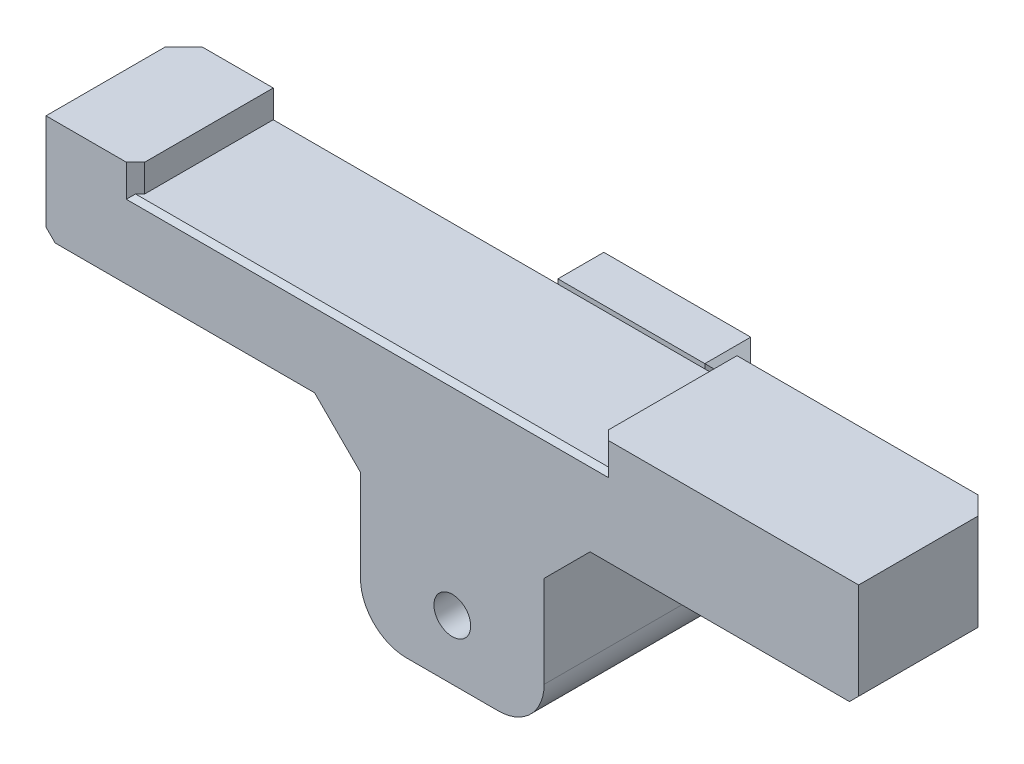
ISO-10303-21;
HEADER;
FILE_DESCRIPTION(('STEP AP214'),'2;1');
FILE_NAME('part.step','',(''),(''),'','','');
FILE_SCHEMA(('AUTOMOTIVE_DESIGN { 1 0 10303 214 1 1 1 1 }'));
ENDSEC;
DATA;
#1=APPLICATION_CONTEXT('core data for automotive mechanical design processes');
#2=APPLICATION_PROTOCOL_DEFINITION('international standard','automotive_design',2000,#1);
#3=PRODUCT_CONTEXT('',#1,'mechanical');
#4=PRODUCT('Part','Part','',(#3));
#5=PRODUCT_RELATED_PRODUCT_CATEGORY('part','',(#4));
#6=PRODUCT_DEFINITION_FORMATION('','',#4);
#7=PRODUCT_DEFINITION_CONTEXT('part definition',#1,'design');
#8=PRODUCT_DEFINITION('design','',#6,#7);
#9=PRODUCT_DEFINITION_SHAPE('','',#8);
#10=(LENGTH_UNIT() NAMED_UNIT(*) SI_UNIT(.MILLI.,.METRE.));
#11=(NAMED_UNIT(*) PLANE_ANGLE_UNIT() SI_UNIT($,.RADIAN.));
#12=(NAMED_UNIT(*) SI_UNIT($,.STERADIAN.) SOLID_ANGLE_UNIT());
#13=UNCERTAINTY_MEASURE_WITH_UNIT(LENGTH_MEASURE(1.E-05),#10,'distance_accuracy_value','');
#14=(GEOMETRIC_REPRESENTATION_CONTEXT(3) GLOBAL_UNCERTAINTY_ASSIGNED_CONTEXT((#13)) GLOBAL_UNIT_ASSIGNED_CONTEXT((#10,
#11,#12)) REPRESENTATION_CONTEXT('',''));
#15=CARTESIAN_POINT('',(0.,0.,0.));
#16=DIRECTION('',(0.,0.,1.));
#17=DIRECTION('',(1.,0.,0.));
#18=AXIS2_PLACEMENT_3D('',#15,#16,#17);
#19=CARTESIAN_POINT('',(-88.5,11.5,30.));
#20=DIRECTION('',(0.,-1.,0.));
#21=DIRECTION('',(0.,0.,-1.));
#22=AXIS2_PLACEMENT_3D('',#19,#20,#21);
#23=PLANE('',#22);
#24=DIRECTION('',(-1.,0.,0.));
#25=VECTOR('',#24,1.);
#26=CARTESIAN_POINT('',(-88.5,11.5,30.));
#27=LINE('',#26,#25);
#28=CARTESIAN_POINT('',(-71.,11.5,30.));
#29=VERTEX_POINT('',#28);
#30=CARTESIAN_POINT('',(-88.5,11.5,30.));
#31=VERTEX_POINT('',#30);
#32=EDGE_CURVE('E541',#29,#31,#27,.T.);
#33=ORIENTED_EDGE('',*,*,#32,.F.);
#34=DIRECTION('',(-0.707106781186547,0.,0.707106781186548));
#35=VECTOR('',#34,1.);
#36=CARTESIAN_POINT('',(-69.,11.5,28.));
#37=LINE('',#36,#35);
#38=CARTESIAN_POINT('',(-69.,11.5,28.));
#39=VERTEX_POINT('',#38);
#40=EDGE_CURVE('E454',#29,#39,#37,.F.);
#41=ORIENTED_EDGE('',*,*,#40,.T.);
#42=DIRECTION('',(0.,0.,1.));
#43=VECTOR('',#42,1.);
#44=CARTESIAN_POINT('',(-69.,11.5,-19.001));
#45=LINE('',#44,#43);
#46=CARTESIAN_POINT('',(-69.,11.5,0.));
#47=VERTEX_POINT('',#46);
#48=EDGE_CURVE('E289',#47,#39,#45,.T.);
#49=ORIENTED_EDGE('',*,*,#48,.F.);
#50=DIRECTION('',(-1.,0.,0.));
#51=VECTOR('',#50,1.);
#52=CARTESIAN_POINT('',(-88.5,11.5,0.));
#53=LINE('',#52,#51);
#54=CARTESIAN_POINT('',(-84.5,11.5,0.));
#55=VERTEX_POINT('',#54);
#56=EDGE_CURVE('E306',#47,#55,#53,.T.);
#57=ORIENTED_EDGE('',*,*,#56,.T.);
#58=DIRECTION('',(-0.70710678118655,0.,0.707106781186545));
#59=VECTOR('',#58,1.);
#60=CARTESIAN_POINT('',(-88.5,11.5,4.));
#61=LINE('',#60,#59);
#62=CARTESIAN_POINT('',(-88.5,11.5,4.));
#63=VERTEX_POINT('',#62);
#64=EDGE_CURVE('E350',#55,#63,#61,.T.);
#65=ORIENTED_EDGE('',*,*,#64,.T.);
#66=DIRECTION('',(0.,0.,-1.));
#67=VECTOR('',#66,1.);
#68=CARTESIAN_POINT('',(-88.5,11.5,30.));
#69=LINE('',#68,#67);
#70=EDGE_CURVE('E318',#31,#63,#69,.T.);
#71=ORIENTED_EDGE('',*,*,#70,.F.);
#72=EDGE_LOOP('',(#33,#41,#49,#57,#65,#71));
#73=FACE_BOUND('',#72,.T.);
#74=ADVANCED_FACE('F38',(#73),#23,.F.);
#75=CARTESIAN_POINT('',(-88.5,-11.5,30.));
#76=DIRECTION('',(0.,1.,0.));
#77=DIRECTION('',(0.,0.,1.));
#78=AXIS2_PLACEMENT_3D('',#75,#76,#77);
#79=PLANE('',#78);
#80=DIRECTION('',(1.,0.,0.));
#81=VECTOR('',#80,1.);
#82=CARTESIAN_POINT('',(-88.5,-11.5,30.));
#83=LINE('',#82,#81);
#84=CARTESIAN_POINT('',(-86.5,-11.5,30.));
#85=VERTEX_POINT('',#84);
#86=CARTESIAN_POINT('',(-29.9999999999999,-11.5,30.));
#87=VERTEX_POINT('',#86);
#88=EDGE_CURVE('E313',#85,#87,#83,.T.);
#89=ORIENTED_EDGE('',*,*,#88,.F.);
#90=DIRECTION('',(0.,0.,-1.));
#91=VECTOR('',#90,1.);
#92=CARTESIAN_POINT('',(-86.5,-11.5,30.));
#93=LINE('',#92,#91);
#94=CARTESIAN_POINT('',(-86.5,-11.5,2.00000000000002));
#95=VERTEX_POINT('',#94);
#96=EDGE_CURVE('E435',#85,#95,#93,.T.);
#97=ORIENTED_EDGE('',*,*,#96,.T.);
#98=DIRECTION('',(0.70710678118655,0.,-0.707106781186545));
#99=VECTOR('',#98,1.);
#100=CARTESIAN_POINT('',(-88.5,-11.5,4.));
#101=LINE('',#100,#99);
#102=CARTESIAN_POINT('',(-84.5,-11.5,0.));
#103=VERTEX_POINT('',#102);
#104=EDGE_CURVE('E364',#95,#103,#101,.T.);
#105=ORIENTED_EDGE('',*,*,#104,.T.);
#106=DIRECTION('',(1.,0.,0.));
#107=VECTOR('',#106,1.);
#108=CARTESIAN_POINT('',(-88.5,-11.5,0.));
#109=LINE('',#108,#107);
#110=CARTESIAN_POINT('',(-29.9999999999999,-11.5,0.));
#111=VERTEX_POINT('',#110);
#112=EDGE_CURVE('E309',#103,#111,#109,.T.);
#113=ORIENTED_EDGE('',*,*,#112,.T.);
#114=DIRECTION('',(0.,0.,1.));
#115=VECTOR('',#114,1.);
#116=CARTESIAN_POINT('',(-29.9999999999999,-11.5,30.));
#117=LINE('',#116,#115);
#118=EDGE_CURVE('E337',#111,#87,#117,.T.);
#119=ORIENTED_EDGE('',*,*,#118,.T.);
#120=EDGE_LOOP('',(#89,#97,#105,#113,#119));
#121=FACE_BOUND('',#120,.T.);
#122=ADVANCED_FACE('F559',(#121),#79,.F.);
#123=CARTESIAN_POINT('',(88.5,-11.5,30.));
#124=DIRECTION('',(-1.,0.,0.));
#125=DIRECTION('',(0.,0.,1.));
#126=AXIS2_PLACEMENT_3D('',#123,#124,#125);
#127=PLANE('',#126);
#128=DIRECTION('',(0.,1.,0.));
#129=VECTOR('',#128,1.);
#130=CARTESIAN_POINT('',(88.5,-11.5,30.));
#131=LINE('',#130,#129);
#132=CARTESIAN_POINT('',(88.5,-9.49999999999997,30.));
#133=VERTEX_POINT('',#132);
#134=CARTESIAN_POINT('',(88.5,11.5,30.));
#135=VERTEX_POINT('',#134);
#136=EDGE_CURVE('E317',#133,#135,#131,.T.);
#137=ORIENTED_EDGE('',*,*,#136,.F.);
#138=DIRECTION('',(0.,0.,-1.));
#139=VECTOR('',#138,1.);
#140=CARTESIAN_POINT('',(88.5,-9.49999999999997,30.));
#141=LINE('',#140,#139);
#142=CARTESIAN_POINT('',(88.5,-9.49999999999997,4.));
#143=VERTEX_POINT('',#142);
#144=EDGE_CURVE('E424',#133,#143,#141,.T.);
#145=ORIENTED_EDGE('',*,*,#144,.T.);
#146=DIRECTION('',(0.,1.,0.));
#147=VECTOR('',#146,1.);
#148=CARTESIAN_POINT('',(88.5,11.5,4.));
#149=LINE('',#148,#147);
#150=CARTESIAN_POINT('',(88.5,11.5,4.));
#151=VERTEX_POINT('',#150);
#152=EDGE_CURVE('E348',#143,#151,#149,.T.);
#153=ORIENTED_EDGE('',*,*,#152,.T.);
#154=DIRECTION('',(0.,0.,-1.));
#155=VECTOR('',#154,1.);
#156=CARTESIAN_POINT('',(88.5,11.5,30.));
#157=LINE('',#156,#155);
#158=EDGE_CURVE('E321',#135,#151,#157,.T.);
#159=ORIENTED_EDGE('',*,*,#158,.F.);
#160=EDGE_LOOP('',(#137,#145,#153,#159));
#161=FACE_BOUND('',#160,.T.);
#162=ADVANCED_FACE('F593',(#161),#127,.F.);
#163=DIRECTION('',(0.,0.,1.));
#164=VECTOR('',#163,1.);
#165=CARTESIAN_POINT('',(32.,11.5,-19.001));
#166=LINE('',#165,#164);
#167=CARTESIAN_POINT('',(32.,11.5,0.));
#168=VERTEX_POINT('',#167);
#169=CARTESIAN_POINT('',(32.,11.5,28.0000000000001));
#170=VERTEX_POINT('',#169);
#171=EDGE_CURVE('E279',#168,#170,#166,.T.);
#172=ORIENTED_EDGE('',*,*,#171,.T.);
#173=DIRECTION('',(-0.707106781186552,0.,-0.707106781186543));
#174=VECTOR('',#173,1.);
#175=CARTESIAN_POINT('',(32.,11.5,28.0000000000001));
#176=LINE('',#175,#174);
#177=CARTESIAN_POINT('',(34.,11.5,30.));
#178=VERTEX_POINT('',#177);
#179=EDGE_CURVE('E457',#170,#178,#176,.F.);
#180=ORIENTED_EDGE('',*,*,#179,.T.);
#181=EDGE_CURVE('E542',#135,#178,#27,.T.);
#182=ORIENTED_EDGE('',*,*,#181,.F.);
#183=ORIENTED_EDGE('',*,*,#158,.T.);
#184=DIRECTION('',(-0.70710678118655,0.,-0.707106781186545));
#185=VECTOR('',#184,1.);
#186=CARTESIAN_POINT('',(88.5,11.5,4.));
#187=LINE('',#186,#185);
#188=CARTESIAN_POINT('',(84.4999999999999,11.5,0.));
#189=VERTEX_POINT('',#188);
#190=EDGE_CURVE('E304',#151,#189,#187,.T.);
#191=ORIENTED_EDGE('',*,*,#190,.T.);
#192=EDGE_CURVE('E296',#189,#168,#53,.T.);
#193=ORIENTED_EDGE('',*,*,#192,.T.);
#194=EDGE_LOOP('',(#172,#180,#182,#183,#191,#193));
#195=FACE_BOUND('',#194,.T.);
#196=ADVANCED_FACE('F301',(#195),#23,.F.);
#197=CARTESIAN_POINT('',(-88.5,-11.5,30.));
#198=DIRECTION('',(1.,0.,0.));
#199=DIRECTION('',(0.,0.,-1.));
#200=AXIS2_PLACEMENT_3D('',#197,#198,#199);
#201=PLANE('',#200);
#202=DIRECTION('',(0.,-1.,0.));
#203=VECTOR('',#202,1.);
#204=CARTESIAN_POINT('',(-88.5,-11.5,4.));
#205=LINE('',#204,#203);
#206=CARTESIAN_POINT('',(-88.5,-9.5,4.));
#207=VERTEX_POINT('',#206);
#208=EDGE_CURVE('E361',#63,#207,#205,.T.);
#209=ORIENTED_EDGE('',*,*,#208,.T.);
#210=DIRECTION('',(0.,0.,1.));
#211=VECTOR('',#210,1.);
#212=CARTESIAN_POINT('',(-88.5,-9.5,30.));
#213=LINE('',#212,#211);
#214=CARTESIAN_POINT('',(-88.5,-9.5,30.));
#215=VERTEX_POINT('',#214);
#216=EDGE_CURVE('E440',#207,#215,#213,.T.);
#217=ORIENTED_EDGE('',*,*,#216,.T.);
#218=DIRECTION('',(0.,-1.,0.));
#219=VECTOR('',#218,1.);
#220=CARTESIAN_POINT('',(-88.5,-11.5,30.));
#221=LINE('',#220,#219);
#222=EDGE_CURVE('E544',#31,#215,#221,.T.);
#223=ORIENTED_EDGE('',*,*,#222,.F.);
#224=ORIENTED_EDGE('',*,*,#70,.T.);
#225=EDGE_LOOP('',(#209,#217,#223,#224));
#226=FACE_BOUND('',#225,.T.);
#227=ADVANCED_FACE('F600',(#226),#201,.F.);
#228=DIRECTION('',(0.70710678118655,0.,0.707106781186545));
#229=VECTOR('',#228,1.);
#230=CARTESIAN_POINT('',(88.5,-11.5,4.));
#231=LINE('',#230,#229);
#232=CARTESIAN_POINT('',(84.4999999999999,-11.5,0.));
#233=VERTEX_POINT('',#232);
#234=CARTESIAN_POINT('',(86.4999999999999,-11.5,1.99999999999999));
#235=VERTEX_POINT('',#234);
#236=EDGE_CURVE('E358',#233,#235,#231,.T.);
#237=ORIENTED_EDGE('',*,*,#236,.T.);
#238=DIRECTION('',(0.,0.,1.));
#239=VECTOR('',#238,1.);
#240=CARTESIAN_POINT('',(86.4999999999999,-11.5,30.));
#241=LINE('',#240,#239);
#242=CARTESIAN_POINT('',(86.4999999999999,-11.5,30.));
#243=VERTEX_POINT('',#242);
#244=EDGE_CURVE('E429',#235,#243,#241,.T.);
#245=ORIENTED_EDGE('',*,*,#244,.T.);
#246=CARTESIAN_POINT('',(30.0000000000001,-11.5,30.));
#247=VERTEX_POINT('',#246);
#248=EDGE_CURVE('E546',#247,#243,#83,.T.);
#249=ORIENTED_EDGE('',*,*,#248,.F.);
#250=DIRECTION('',(0.,0.,-1.));
#251=VECTOR('',#250,1.);
#252=CARTESIAN_POINT('',(30.0000000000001,-11.5,0.));
#253=LINE('',#252,#251);
#254=CARTESIAN_POINT('',(30.0000000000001,-11.5,0.));
#255=VERTEX_POINT('',#254);
#256=EDGE_CURVE('E323',#247,#255,#253,.T.);
#257=ORIENTED_EDGE('',*,*,#256,.T.);
#258=EDGE_CURVE('E305',#255,#233,#109,.T.);
#259=ORIENTED_EDGE('',*,*,#258,.T.);
#260=EDGE_LOOP('',(#237,#245,#249,#257,#259));
#261=FACE_BOUND('',#260,.T.);
#262=ADVANCED_FACE('F595',(#261),#79,.F.);
#263=CARTESIAN_POINT('',(0.,0.,30.));
#264=DIRECTION('',(0.,0.,-1.));
#265=DIRECTION('',(-1.,0.,0.));
#266=AXIS2_PLACEMENT_3D('',#263,#264,#265);
#267=PLANE('',#266);
#268=CARTESIAN_POINT('',(0.,-38.5,30.));
#269=DIRECTION('',(0.,0.,1.));
#270=DIRECTION('',(1.,0.,0.));
#271=AXIS2_PLACEMENT_3D('',#268,#269,#270);
#272=CIRCLE('',#271,4.);
#273=CARTESIAN_POINT('',(4.,-38.5,30.));
#274=VERTEX_POINT('',#273);
#275=EDGE_CURVE('E447',#274,#274,#272,.T.);
#276=ORIENTED_EDGE('',*,*,#275,.F.);
#277=EDGE_LOOP('',(#276));
#278=FACE_BOUND('',#277,.T.);
#279=DIRECTION('',(0.,-1.,0.));
#280=VECTOR('',#279,1.);
#281=CARTESIAN_POINT('',(-20.,0.,30.));
#282=LINE('',#281,#280);
#283=CARTESIAN_POINT('',(-20.,-21.5,30.));
#284=VERTEX_POINT('',#283);
#285=CARTESIAN_POINT('',(-20.,-41.5,30.));
#286=VERTEX_POINT('',#285);
#287=EDGE_CURVE('E531',#284,#286,#282,.T.);
#288=ORIENTED_EDGE('',*,*,#287,.T.);
#289=CARTESIAN_POINT('',(-10.,-41.5,30.));
#290=DIRECTION('',(0.,0.,-1.));
#291=DIRECTION('',(-1.,0.,0.));
#292=AXIS2_PLACEMENT_3D('',#289,#290,#291);
#293=CIRCLE('',#292,10.);
#294=CARTESIAN_POINT('',(-10.,-51.5,30.));
#295=VERTEX_POINT('',#294);
#296=EDGE_CURVE('E489',#286,#295,#293,.F.);
#297=ORIENTED_EDGE('',*,*,#296,.T.);
#298=DIRECTION('',(1.,0.,0.));
#299=VECTOR('',#298,1.);
#300=CARTESIAN_POINT('',(0.,-51.5,30.));
#301=LINE('',#300,#299);
#302=CARTESIAN_POINT('',(9.99999999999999,-51.5,30.));
#303=VERTEX_POINT('',#302);
#304=EDGE_CURVE('E311',#295,#303,#301,.T.);
#305=ORIENTED_EDGE('',*,*,#304,.T.);
#306=CARTESIAN_POINT('',(9.99999999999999,-41.5,30.));
#307=DIRECTION('',(0.,0.,-1.));
#308=DIRECTION('',(-1.,0.,0.));
#309=AXIS2_PLACEMENT_3D('',#306,#307,#308);
#310=CIRCLE('',#309,10.);
#311=CARTESIAN_POINT('',(20.,-41.5,30.));
#312=VERTEX_POINT('',#311);
#313=EDGE_CURVE('E59',#303,#312,#310,.F.);
#314=ORIENTED_EDGE('',*,*,#313,.T.);
#315=DIRECTION('',(0.,-1.,0.));
#316=VECTOR('',#315,1.);
#317=CARTESIAN_POINT('',(20.,0.,30.));
#318=LINE('',#317,#316);
#319=CARTESIAN_POINT('',(20.,-21.5,30.));
#320=VERTEX_POINT('',#319);
#321=EDGE_CURVE('E494',#320,#312,#318,.T.);
#322=ORIENTED_EDGE('',*,*,#321,.F.);
#323=DIRECTION('',(-0.707106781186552,-0.707106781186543,0.));
#324=VECTOR('',#323,1.);
#325=CARTESIAN_POINT('',(20.7499999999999,-20.7500000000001,30.));
#326=LINE('',#325,#324);
#327=EDGE_CURVE('E342',#320,#247,#326,.F.);
#328=ORIENTED_EDGE('',*,*,#327,.T.);
#329=ORIENTED_EDGE('',*,*,#248,.T.);
#330=DIRECTION('',(-0.707106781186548,-0.707106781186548,0.));
#331=VECTOR('',#330,1.);
#332=CARTESIAN_POINT('',(88.5,-9.49999999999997,30.));
#333=LINE('',#332,#331);
#334=EDGE_CURVE('E433',#243,#133,#333,.F.);
#335=ORIENTED_EDGE('',*,*,#334,.T.);
#336=ORIENTED_EDGE('',*,*,#136,.T.);
#337=ORIENTED_EDGE('',*,*,#181,.T.);
#338=DIRECTION('',(0.,-1.,0.));
#339=VECTOR('',#338,1.);
#340=CARTESIAN_POINT('',(34.,0.,30.));
#341=LINE('',#340,#339);
#342=CARTESIAN_POINT('',(34.,4.5,30.));
#343=VERTEX_POINT('',#342);
#344=EDGE_CURVE('E450',#178,#343,#341,.T.);
#345=ORIENTED_EDGE('',*,*,#344,.T.);
#346=DIRECTION('',(-1.,0.,0.));
#347=VECTOR('',#346,1.);
#348=CARTESIAN_POINT('',(0.,4.5,30.));
#349=LINE('',#348,#347);
#350=CARTESIAN_POINT('',(-71.,4.5,30.));
#351=VERTEX_POINT('',#350);
#352=EDGE_CURVE('E467',#343,#351,#349,.T.);
#353=ORIENTED_EDGE('',*,*,#352,.T.);
#354=DIRECTION('',(0.,1.,0.));
#355=VECTOR('',#354,1.);
#356=CARTESIAN_POINT('',(-71.,-1.64220489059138E-13,30.));
#357=LINE('',#356,#355);
#358=EDGE_CURVE('E452',#351,#29,#357,.T.);
#359=ORIENTED_EDGE('',*,*,#358,.T.);
#360=ORIENTED_EDGE('',*,*,#32,.T.);
#361=ORIENTED_EDGE('',*,*,#222,.T.);
#362=DIRECTION('',(-0.707106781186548,0.707106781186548,0.));
#363=VECTOR('',#362,1.);
#364=CARTESIAN_POINT('',(-86.5,-11.5,30.));
#365=LINE('',#364,#363);
#366=EDGE_CURVE('E431',#215,#85,#365,.F.);
#367=ORIENTED_EDGE('',*,*,#366,.T.);
#368=ORIENTED_EDGE('',*,*,#88,.T.);
#369=DIRECTION('',(0.707106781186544,-0.707106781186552,0.));
#370=VECTOR('',#369,1.);
#371=CARTESIAN_POINT('',(-20.7500000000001,-20.7499999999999,30.));
#372=LINE('',#371,#370);
#373=EDGE_CURVE('E346',#87,#284,#372,.T.);
#374=ORIENTED_EDGE('',*,*,#373,.T.);
#375=EDGE_LOOP('',(#288,#297,#305,#314,#322,#328,#329,#335,#336,#337,#345,#353,#359,#360,#361,
#367,#368,#374));
#376=FACE_BOUND('',#375,.T.);
#377=ADVANCED_FACE('F553',(#278,#376),#267,.F.);
#378=CARTESIAN_POINT('',(0.,0.,0.));
#379=DIRECTION('',(0.,0.,-1.));
#380=DIRECTION('',(-1.,0.,0.));
#381=AXIS2_PLACEMENT_3D('',#378,#379,#380);
#382=PLANE('',#381);
#383=DIRECTION('',(0.,-1.,0.));
#384=VECTOR('',#383,1.);
#385=CARTESIAN_POINT('',(-69.,11.5,0.));
#386=LINE('',#385,#384);
#387=CARTESIAN_POINT('',(-69.,5.5,0.));
#388=VERTEX_POINT('',#387);
#389=EDGE_CURVE('E299',#47,#388,#386,.T.);
#390=ORIENTED_EDGE('',*,*,#389,.T.);
#391=DIRECTION('',(1.,0.,0.));
#392=VECTOR('',#391,1.);
#393=CARTESIAN_POINT('',(-69.,5.5,0.));
#394=LINE('',#393,#392);
#395=CARTESIAN_POINT('',(32.,5.5,0.));
#396=VERTEX_POINT('',#395);
#397=EDGE_CURVE('E298',#388,#396,#394,.T.);
#398=ORIENTED_EDGE('',*,*,#397,.T.);
#399=DIRECTION('',(0.,1.,0.));
#400=VECTOR('',#399,1.);
#401=CARTESIAN_POINT('',(32.,11.5,0.));
#402=LINE('',#401,#400);
#403=EDGE_CURVE('E283',#396,#168,#402,.T.);
#404=ORIENTED_EDGE('',*,*,#403,.T.);
#405=ORIENTED_EDGE('',*,*,#192,.F.);
#406=DIRECTION('',(0.,-1.,0.));
#407=VECTOR('',#406,1.);
#408=CARTESIAN_POINT('',(84.4999999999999,-11.5,0.));
#409=LINE('',#408,#407);
#410=EDGE_CURVE('E356',#189,#233,#409,.T.);
#411=ORIENTED_EDGE('',*,*,#410,.T.);
#412=ORIENTED_EDGE('',*,*,#258,.F.);
#413=DIRECTION('',(0.707106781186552,0.707106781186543,0.));
#414=VECTOR('',#413,1.);
#415=CARTESIAN_POINT('',(30.0000000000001,-11.5,0.));
#416=LINE('',#415,#414);
#417=CARTESIAN_POINT('',(20.,-21.5,0.));
#418=VERTEX_POINT('',#417);
#419=EDGE_CURVE('E340',#255,#418,#416,.F.);
#420=ORIENTED_EDGE('',*,*,#419,.T.);
#421=DIRECTION('',(0.,-1.,0.));
#422=VECTOR('',#421,1.);
#423=CARTESIAN_POINT('',(20.,0.,0.));
#424=LINE('',#423,#422);
#425=CARTESIAN_POINT('',(20.,-15.5,0.));
#426=VERTEX_POINT('',#425);
#427=EDGE_CURVE('E328',#426,#418,#424,.T.);
#428=ORIENTED_EDGE('',*,*,#427,.F.);
#429=DIRECTION('',(0.70710678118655,-0.707106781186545,0.));
#430=VECTOR('',#429,1.);
#431=CARTESIAN_POINT('',(16.,-11.5,0.));
#432=LINE('',#431,#430);
#433=CARTESIAN_POINT('',(16.7,-12.2,0.));
#434=VERTEX_POINT('',#433);
#435=EDGE_CURVE('E397',#426,#434,#432,.F.);
#436=ORIENTED_EDGE('',*,*,#435,.T.);
#437=DIRECTION('',(1.,0.,0.));
#438=VECTOR('',#437,1.);
#439=CARTESIAN_POINT('',(-88.5,-12.2,0.));
#440=LINE('',#439,#438);
#441=CARTESIAN_POINT('',(-16.7,-12.2,0.));
#442=VERTEX_POINT('',#441);
#443=EDGE_CURVE('E764',#442,#434,#440,.T.);
#444=ORIENTED_EDGE('',*,*,#443,.F.);
#445=DIRECTION('',(-0.707106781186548,-0.707106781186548,0.));
#446=VECTOR('',#445,1.);
#447=CARTESIAN_POINT('',(-20.,-15.5,0.));
#448=LINE('',#447,#446);
#449=CARTESIAN_POINT('',(-20.,-15.5,0.));
#450=VERTEX_POINT('',#449);
#451=EDGE_CURVE('E400',#442,#450,#448,.T.);
#452=ORIENTED_EDGE('',*,*,#451,.T.);
#453=DIRECTION('',(0.,1.,0.));
#454=VECTOR('',#453,1.);
#455=CARTESIAN_POINT('',(-20.,0.,0.));
#456=LINE('',#455,#454);
#457=CARTESIAN_POINT('',(-20.,-21.5,0.));
#458=VERTEX_POINT('',#457);
#459=EDGE_CURVE('E331',#458,#450,#456,.T.);
#460=ORIENTED_EDGE('',*,*,#459,.F.);
#461=DIRECTION('',(-0.707106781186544,0.707106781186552,0.));
#462=VECTOR('',#461,1.);
#463=CARTESIAN_POINT('',(-20.,-21.5,0.));
#464=LINE('',#463,#462);
#465=EDGE_CURVE('E344',#458,#111,#464,.T.);
#466=ORIENTED_EDGE('',*,*,#465,.T.);
#467=ORIENTED_EDGE('',*,*,#112,.F.);
#468=DIRECTION('',(0.,1.,0.));
#469=VECTOR('',#468,1.);
#470=CARTESIAN_POINT('',(-84.5,11.5,0.));
#471=LINE('',#470,#469);
#472=EDGE_CURVE('E353',#103,#55,#471,.T.);
#473=ORIENTED_EDGE('',*,*,#472,.T.);
#474=ORIENTED_EDGE('',*,*,#56,.F.);
#475=EDGE_LOOP('',(#390,#398,#404,#405,#411,#412,#420,#428,#436,#444,#452,#460,#466,#467,#473,#474));
#476=FACE_BOUND('',#475,.T.);
#477=ADVANCED_FACE('F295',(#476),#382,.T.);
#478=CARTESIAN_POINT('',(20.,0.,86.5685424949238));
#479=DIRECTION('',(-1.,0.,0.));
#480=DIRECTION('',(0.,-1.,0.));
#481=AXIS2_PLACEMENT_3D('',#478,#479,#480);
#482=PLANE('',#481);
#483=ORIENTED_EDGE('',*,*,#321,.T.);
#484=DIRECTION('',(0.,0.,-1.));
#485=VECTOR('',#484,1.);
#486=CARTESIAN_POINT('',(20.,-41.5,-15.));
#487=LINE('',#486,#485);
#488=CARTESIAN_POINT('',(20.,-41.5,-15.));
#489=VERTEX_POINT('',#488);
#490=EDGE_CURVE('E46',#312,#489,#487,.T.);
#491=ORIENTED_EDGE('',*,*,#490,.T.);
#492=DIRECTION('',(0.,1.,0.));
#493=VECTOR('',#492,1.);
#494=CARTESIAN_POINT('',(20.,-2.5,-15.));
#495=LINE('',#494,#493);
#496=CARTESIAN_POINT('',(20.,-6.49999999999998,-15.));
#497=VERTEX_POINT('',#496);
#498=EDGE_CURVE('E366',#489,#497,#495,.T.);
#499=ORIENTED_EDGE('',*,*,#498,.T.);
#500=DIRECTION('',(0.,0.,1.));
#501=VECTOR('',#500,1.);
#502=CARTESIAN_POINT('',(20.,-6.49999999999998,86.5685424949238));
#503=LINE('',#502,#501);
#504=CARTESIAN_POINT('',(20.,-6.49999999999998,-13.));
#505=VERTEX_POINT('',#504);
#506=EDGE_CURVE('E368',#497,#505,#503,.T.);
#507=ORIENTED_EDGE('',*,*,#506,.T.);
#508=DIRECTION('',(0.,-1.,0.));
#509=VECTOR('',#508,1.);
#510=CARTESIAN_POINT('',(20.,0.,-13.));
#511=LINE('',#510,#509);
#512=CARTESIAN_POINT('',(20.,-15.5,-13.));
#513=VERTEX_POINT('',#512);
#514=EDGE_CURVE('E370',#505,#513,#511,.T.);
#515=ORIENTED_EDGE('',*,*,#514,.T.);
#516=DIRECTION('',(0.,0.,1.));
#517=VECTOR('',#516,1.);
#518=CARTESIAN_POINT('',(20.,-15.5,86.5685424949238));
#519=LINE('',#518,#517);
#520=EDGE_CURVE('E372',#513,#426,#519,.T.);
#521=ORIENTED_EDGE('',*,*,#520,.T.);
#522=ORIENTED_EDGE('',*,*,#427,.T.);
#523=DIRECTION('',(0.,0.,1.));
#524=VECTOR('',#523,1.);
#525=CARTESIAN_POINT('',(20.,-21.5,30.));
#526=LINE('',#525,#524);
#527=EDGE_CURVE('E326',#418,#320,#526,.T.);
#528=ORIENTED_EDGE('',*,*,#527,.T.);
#529=EDGE_LOOP('',(#483,#491,#499,#507,#515,#521,#522,#528));
#530=FACE_BOUND('',#529,.T.);
#531=ADVANCED_FACE('F492',(#530),#482,.F.);
#532=CARTESIAN_POINT('',(-20.,0.,86.5685424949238));
#533=DIRECTION('',(-1.,0.,0.));
#534=DIRECTION('',(0.,0.,1.));
#535=AXIS2_PLACEMENT_3D('',#532,#533,#534);
#536=PLANE('',#535);
#537=DIRECTION('',(0.,-1.,0.));
#538=VECTOR('',#537,1.);
#539=CARTESIAN_POINT('',(-20.,0.,-15.));
#540=LINE('',#539,#538);
#541=CARTESIAN_POINT('',(-20.,-6.49999999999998,-15.));
#542=VERTEX_POINT('',#541);
#543=CARTESIAN_POINT('',(-20.,-41.5,-15.));
#544=VERTEX_POINT('',#543);
#545=EDGE_CURVE('E394',#542,#544,#540,.T.);
#546=ORIENTED_EDGE('',*,*,#545,.T.);
#547=DIRECTION('',(0.,0.,-1.));
#548=VECTOR('',#547,1.);
#549=CARTESIAN_POINT('',(-20.,-41.5,86.5685424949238));
#550=LINE('',#549,#548);
#551=EDGE_CURVE('E486',#544,#286,#550,.F.);
#552=ORIENTED_EDGE('',*,*,#551,.T.);
#553=ORIENTED_EDGE('',*,*,#287,.F.);
#554=DIRECTION('',(0.,0.,-1.));
#555=VECTOR('',#554,1.);
#556=CARTESIAN_POINT('',(-20.,-21.5,86.5685424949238));
#557=LINE('',#556,#555);
#558=EDGE_CURVE('E334',#284,#458,#557,.T.);
#559=ORIENTED_EDGE('',*,*,#558,.T.);
#560=ORIENTED_EDGE('',*,*,#459,.T.);
#561=DIRECTION('',(0.,0.,-1.));
#562=VECTOR('',#561,1.);
#563=CARTESIAN_POINT('',(-20.,-15.5,-8.99999999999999));
#564=LINE('',#563,#562);
#565=CARTESIAN_POINT('',(-20.,-15.5,-13.));
#566=VERTEX_POINT('',#565);
#567=EDGE_CURVE('E390',#450,#566,#564,.T.);
#568=ORIENTED_EDGE('',*,*,#567,.T.);
#569=DIRECTION('',(0.,1.,0.));
#570=VECTOR('',#569,1.);
#571=CARTESIAN_POINT('',(-20.,-2.5,-13.));
#572=LINE('',#571,#570);
#573=CARTESIAN_POINT('',(-20.,-6.49999999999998,-13.));
#574=VERTEX_POINT('',#573);
#575=EDGE_CURVE('E388',#566,#574,#572,.T.);
#576=ORIENTED_EDGE('',*,*,#575,.T.);
#577=DIRECTION('',(0.,0.,-1.));
#578=VECTOR('',#577,1.);
#579=CARTESIAN_POINT('',(-20.,-6.49999999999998,-19.));
#580=LINE('',#579,#578);
#581=EDGE_CURVE('E392',#574,#542,#580,.T.);
#582=ORIENTED_EDGE('',*,*,#581,.T.);
#583=EDGE_LOOP('',(#546,#552,#553,#559,#560,#568,#576,#582));
#584=FACE_BOUND('',#583,.T.);
#585=ADVANCED_FACE('F566',(#584),#536,.T.);
#586=CARTESIAN_POINT('',(0.,-51.5,86.5685424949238));
#587=DIRECTION('',(0.,-1.,0.));
#588=DIRECTION('',(1.,0.,0.));
#589=AXIS2_PLACEMENT_3D('',#586,#587,#588);
#590=PLANE('',#589);
#591=DIRECTION('',(0.,0.,1.));
#592=VECTOR('',#591,1.);
#593=CARTESIAN_POINT('',(6.9,-51.5,86.5685424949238));
#594=LINE('',#593,#592);
#595=CARTESIAN_POINT('',(6.9,-51.5,17.));
#596=VERTEX_POINT('',#595);
#597=CARTESIAN_POINT('',(6.9,-51.5,24.));
#598=VERTEX_POINT('',#597);
#599=EDGE_CURVE('E446',#596,#598,#594,.T.);
#600=ORIENTED_EDGE('',*,*,#599,.F.);
#601=DIRECTION('',(-1.,0.,0.));
#602=VECTOR('',#601,1.);
#603=CARTESIAN_POINT('',(0.,-51.5,17.));
#604=LINE('',#603,#602);
#605=CARTESIAN_POINT('',(-6.9,-51.5,17.));
#606=VERTEX_POINT('',#605);
#607=EDGE_CURVE('E745',#596,#606,#604,.T.);
#608=ORIENTED_EDGE('',*,*,#607,.T.);
#609=DIRECTION('',(0.,0.,1.));
#610=VECTOR('',#609,1.);
#611=CARTESIAN_POINT('',(-6.9,-51.5,86.5685424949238));
#612=LINE('',#611,#610);
#613=CARTESIAN_POINT('',(-6.9,-51.5,24.));
#614=VERTEX_POINT('',#613);
#615=EDGE_CURVE('E757',#606,#614,#612,.T.);
#616=ORIENTED_EDGE('',*,*,#615,.T.);
#617=DIRECTION('',(-1.,0.,0.));
#618=VECTOR('',#617,1.);
#619=CARTESIAN_POINT('',(0.,-51.5,24.));
#620=LINE('',#619,#618);
#621=EDGE_CURVE('E754',#598,#614,#620,.T.);
#622=ORIENTED_EDGE('',*,*,#621,.F.);
#623=EDGE_LOOP('',(#600,#608,#616,#622));
#624=FACE_BOUND('',#623,.T.);
#625=ORIENTED_EDGE('',*,*,#304,.F.);
#626=DIRECTION('',(0.,0.,-1.));
#627=VECTOR('',#626,1.);
#628=CARTESIAN_POINT('',(-10.,-51.5,86.5685424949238));
#629=LINE('',#628,#627);
#630=CARTESIAN_POINT('',(-10.,-51.5,-19.));
#631=VERTEX_POINT('',#630);
#632=EDGE_CURVE('E477',#295,#631,#629,.T.);
#633=ORIENTED_EDGE('',*,*,#632,.T.);
#634=DIRECTION('',(-1.,0.,0.));
#635=VECTOR('',#634,1.);
#636=CARTESIAN_POINT('',(0.,-51.5,-19.));
#637=LINE('',#636,#635);
#638=CARTESIAN_POINT('',(9.99999999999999,-51.5,-19.));
#639=VERTEX_POINT('',#638);
#640=EDGE_CURVE('E528',#639,#631,#637,.T.);
#641=ORIENTED_EDGE('',*,*,#640,.F.);
#642=DIRECTION('',(0.,0.,-1.));
#643=VECTOR('',#642,1.);
#644=CARTESIAN_POINT('',(9.99999999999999,-51.5,30.));
#645=LINE('',#644,#643);
#646=EDGE_CURVE('E475',#639,#303,#645,.F.);
#647=ORIENTED_EDGE('',*,*,#646,.T.);
#648=EDGE_LOOP('',(#625,#633,#641,#647));
#649=FACE_BOUND('',#648,.T.);
#650=ADVANCED_FACE('F577',(#624,#649),#590,.T.);
#651=CARTESIAN_POINT('',(0.,0.,-19.));
#652=DIRECTION('',(0.,0.,-1.));
#653=DIRECTION('',(-1.,0.,0.));
#654=AXIS2_PLACEMENT_3D('',#651,#652,#653);
#655=PLANE('',#654);
#656=ORIENTED_EDGE('',*,*,#640,.T.);
#657=CARTESIAN_POINT('',(-10.,-41.5,-19.));
#658=DIRECTION('',(0.,0.,-1.));
#659=DIRECTION('',(-1.,0.,0.));
#660=AXIS2_PLACEMENT_3D('',#657,#658,#659);
#661=CIRCLE('',#660,10.);
#662=CARTESIAN_POINT('',(-16.,-49.5,-19.));
#663=VERTEX_POINT('',#662);
#664=EDGE_CURVE('E482',#631,#663,#661,.T.);
#665=ORIENTED_EDGE('',*,*,#664,.T.);
#666=DIRECTION('',(0.,1.,0.));
#667=VECTOR('',#666,1.);
#668=CARTESIAN_POINT('',(-16.,0.,-19.));
#669=LINE('',#668,#667);
#670=CARTESIAN_POINT('',(-16.,-2.5,-19.));
#671=VERTEX_POINT('',#670);
#672=EDGE_CURVE('E383',#663,#671,#669,.T.);
#673=ORIENTED_EDGE('',*,*,#672,.T.);
#674=DIRECTION('',(-1.,0.,0.));
#675=VECTOR('',#674,1.);
#676=CARTESIAN_POINT('',(20.,-2.5,-19.));
#677=LINE('',#676,#675);
#678=CARTESIAN_POINT('',(16.,-2.5,-19.));
#679=VERTEX_POINT('',#678);
#680=EDGE_CURVE('E413',#679,#671,#677,.T.);
#681=ORIENTED_EDGE('',*,*,#680,.F.);
#682=DIRECTION('',(0.,-1.,0.));
#683=VECTOR('',#682,1.);
#684=CARTESIAN_POINT('',(16.,-51.5,-19.));
#685=LINE('',#684,#683);
#686=CARTESIAN_POINT('',(16.,-49.5,-19.));
#687=VERTEX_POINT('',#686);
#688=EDGE_CURVE('E385',#679,#687,#685,.T.);
#689=ORIENTED_EDGE('',*,*,#688,.T.);
#690=CARTESIAN_POINT('',(9.99999999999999,-41.5,-19.));
#691=DIRECTION('',(0.,0.,-1.));
#692=DIRECTION('',(-1.,0.,0.));
#693=AXIS2_PLACEMENT_3D('',#690,#691,#692);
#694=CIRCLE('',#693,10.);
#695=EDGE_CURVE('E480',#687,#639,#694,.T.);
#696=ORIENTED_EDGE('',*,*,#695,.T.);
#697=EDGE_LOOP('',(#656,#665,#673,#681,#689,#696));
#698=FACE_BOUND('',#697,.T.);
#699=ADVANCED_FACE('F580',(#698),#655,.T.);
#700=CARTESIAN_POINT('',(20.,-2.5,-9.));
#701=DIRECTION('',(0.,0.,-1.));
#702=DIRECTION('',(-1.,0.,0.));
#703=AXIS2_PLACEMENT_3D('',#700,#701,#702);
#704=PLANE('',#703);
#705=DIRECTION('',(0.,-1.,0.));
#706=VECTOR('',#705,1.);
#707=CARTESIAN_POINT('',(-16.,-11.5,-8.99999999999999));
#708=LINE('',#707,#706);
#709=CARTESIAN_POINT('',(-16.,-2.5,-8.99999999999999));
#710=VERTEX_POINT('',#709);
#711=CARTESIAN_POINT('',(-16.,-11.5,-8.99999999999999));
#712=VERTEX_POINT('',#711);
#713=EDGE_CURVE('E374',#710,#712,#708,.T.);
#714=ORIENTED_EDGE('',*,*,#713,.T.);
#715=DIRECTION('',(-0.707106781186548,-0.707106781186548,0.));
#716=VECTOR('',#715,1.);
#717=CARTESIAN_POINT('',(-20.,-15.5,-8.99999999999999));
#718=LINE('',#717,#716);
#719=CARTESIAN_POINT('',(-16.7,-12.2,-8.99999999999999));
#720=VERTEX_POINT('',#719);
#721=EDGE_CURVE('E773',#712,#720,#718,.T.);
#722=ORIENTED_EDGE('',*,*,#721,.T.);
#723=DIRECTION('',(1.,0.,0.));
#724=VECTOR('',#723,1.);
#725=CARTESIAN_POINT('',(-88.5,-12.2,-8.99999999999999));
#726=LINE('',#725,#724);
#727=CARTESIAN_POINT('',(16.7,-12.2,-8.99999999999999));
#728=VERTEX_POINT('',#727);
#729=EDGE_CURVE('E771',#720,#728,#726,.T.);
#730=ORIENTED_EDGE('',*,*,#729,.T.);
#731=DIRECTION('',(0.70710678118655,-0.707106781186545,0.));
#732=VECTOR('',#731,1.);
#733=CARTESIAN_POINT('',(16.,-11.5,-8.99999999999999));
#734=LINE('',#733,#732);
#735=CARTESIAN_POINT('',(16.,-11.5,-8.99999999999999));
#736=VERTEX_POINT('',#735);
#737=EDGE_CURVE('E522',#728,#736,#734,.F.);
#738=ORIENTED_EDGE('',*,*,#737,.T.);
#739=DIRECTION('',(0.,1.,0.));
#740=VECTOR('',#739,1.);
#741=CARTESIAN_POINT('',(16.,-2.5,-9.));
#742=LINE('',#741,#740);
#743=CARTESIAN_POINT('',(16.,-2.5,-9.));
#744=VERTEX_POINT('',#743);
#745=EDGE_CURVE('E377',#736,#744,#742,.T.);
#746=ORIENTED_EDGE('',*,*,#745,.T.);
#747=DIRECTION('',(1.,0.,0.));
#748=VECTOR('',#747,1.);
#749=CARTESIAN_POINT('',(20.,-2.5,-9.));
#750=LINE('',#749,#748);
#751=EDGE_CURVE('E519',#710,#744,#750,.T.);
#752=ORIENTED_EDGE('',*,*,#751,.F.);
#753=EDGE_LOOP('',(#714,#722,#730,#738,#746,#752));
#754=FACE_BOUND('',#753,.T.);
#755=ADVANCED_FACE('F518',(#754),#704,.F.);
#756=CARTESIAN_POINT('',(0.,-2.5,0.));
#757=DIRECTION('',(0.,-1.,0.));
#758=DIRECTION('',(0.,0.,-1.));
#759=AXIS2_PLACEMENT_3D('',#756,#757,#758);
#760=PLANE('',#759);
#761=ORIENTED_EDGE('',*,*,#751,.T.);
#762=DIRECTION('',(0.,0.,-1.));
#763=VECTOR('',#762,1.);
#764=CARTESIAN_POINT('',(16.,-2.5,0.));
#765=LINE('',#764,#763);
#766=EDGE_CURVE('E381',#744,#679,#765,.T.);
#767=ORIENTED_EDGE('',*,*,#766,.T.);
#768=ORIENTED_EDGE('',*,*,#680,.T.);
#769=DIRECTION('',(0.,0.,1.));
#770=VECTOR('',#769,1.);
#771=CARTESIAN_POINT('',(-16.,-2.5,-8.99999999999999));
#772=LINE('',#771,#770);
#773=EDGE_CURVE('E379',#671,#710,#772,.T.);
#774=ORIENTED_EDGE('',*,*,#773,.T.);
#775=EDGE_LOOP('',(#761,#767,#768,#774));
#776=FACE_BOUND('',#775,.T.);
#777=ADVANCED_FACE('F524',(#776),#760,.F.);
#778=CARTESIAN_POINT('',(30.0000000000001,-11.5,30.));
#779=DIRECTION('',(0.707106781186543,-0.707106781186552,0.));
#780=DIRECTION('',(0.,0.,1.));
#781=AXIS2_PLACEMENT_3D('',#778,#779,#780);
#782=PLANE('',#781);
#783=ORIENTED_EDGE('',*,*,#327,.F.);
#784=ORIENTED_EDGE('',*,*,#527,.F.);
#785=ORIENTED_EDGE('',*,*,#419,.F.);
#786=ORIENTED_EDGE('',*,*,#256,.F.);
#787=EDGE_LOOP('',(#783,#784,#785,#786));
#788=FACE_BOUND('',#787,.T.);
#789=ADVANCED_FACE('F612',(#788),#782,.T.);
#790=CARTESIAN_POINT('',(-20.,-21.5,86.5685424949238));
#791=DIRECTION('',(0.707106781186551,0.707106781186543,0.));
#792=DIRECTION('',(0.,0.,-1.));
#793=AXIS2_PLACEMENT_3D('',#790,#791,#792);
#794=PLANE('',#793);
#795=ORIENTED_EDGE('',*,*,#373,.F.);
#796=ORIENTED_EDGE('',*,*,#118,.F.);
#797=ORIENTED_EDGE('',*,*,#465,.F.);
#798=ORIENTED_EDGE('',*,*,#558,.F.);
#799=EDGE_LOOP('',(#795,#796,#797,#798));
#800=FACE_BOUND('',#799,.T.);
#801=ADVANCED_FACE('F563',(#800),#794,.F.);
#802=CARTESIAN_POINT('',(88.5,-11.5,4.));
#803=DIRECTION('',(0.707106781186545,0.,-0.70710678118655));
#804=DIRECTION('',(0.,-1.,0.));
#805=AXIS2_PLACEMENT_3D('',#802,#803,#804);
#806=PLANE('',#805);
#807=ORIENTED_EDGE('',*,*,#152,.F.);
#808=DIRECTION('',(0.577350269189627,0.577350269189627,0.577350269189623));
#809=VECTOR('',#808,1.);
#810=CARTESIAN_POINT('',(87.8333333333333,-10.1666666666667,3.33333333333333));
#811=LINE('',#810,#809);
#812=EDGE_CURVE('E427',#143,#235,#811,.F.);
#813=ORIENTED_EDGE('',*,*,#812,.T.);
#814=ORIENTED_EDGE('',*,*,#236,.F.);
#815=ORIENTED_EDGE('',*,*,#410,.F.);
#816=ORIENTED_EDGE('',*,*,#190,.F.);
#817=EDGE_LOOP('',(#807,#813,#814,#815,#816));
#818=FACE_BOUND('',#817,.T.);
#819=ADVANCED_FACE('F624',(#818),#806,.T.);
#820=CARTESIAN_POINT('',(-88.5,-11.5,4.));
#821=DIRECTION('',(-0.707106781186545,0.,-0.70710678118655));
#822=DIRECTION('',(0.,1.,0.));
#823=AXIS2_PLACEMENT_3D('',#820,#821,#822);
#824=PLANE('',#823);
#825=ORIENTED_EDGE('',*,*,#104,.F.);
#826=DIRECTION('',(0.577350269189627,-0.577350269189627,-0.577350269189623));
#827=VECTOR('',#826,1.);
#828=CARTESIAN_POINT('',(-87.8333333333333,-10.1666666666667,3.33333333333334));
#829=LINE('',#828,#827);
#830=EDGE_CURVE('E438',#95,#207,#829,.F.);
#831=ORIENTED_EDGE('',*,*,#830,.T.);
#832=ORIENTED_EDGE('',*,*,#208,.F.);
#833=ORIENTED_EDGE('',*,*,#64,.F.);
#834=ORIENTED_EDGE('',*,*,#472,.F.);
#835=EDGE_LOOP('',(#825,#831,#832,#833,#834));
#836=FACE_BOUND('',#835,.T.);
#837=ADVANCED_FACE('F630',(#836),#824,.T.);
#838=CARTESIAN_POINT('',(20.,0.,-15.));
#839=DIRECTION('',(0.707106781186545,0.,-0.70710678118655));
#840=DIRECTION('',(0.,-1.,0.));
#841=AXIS2_PLACEMENT_3D('',#838,#839,#840);
#842=PLANE('',#841);
#843=ORIENTED_EDGE('',*,*,#498,.F.);
#844=CARTESIAN_POINT('',(9.99999999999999,-41.5,-25.));
#845=DIRECTION('',(0.707106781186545,0.,-0.70710678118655));
#846=DIRECTION('',(0.70710678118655,0.,0.707106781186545));
#847=AXIS2_PLACEMENT_3D('',#844,#845,#846);
#848=ELLIPSE('',#847,14.1421356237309,10.);
#849=EDGE_CURVE('E11',#489,#687,#848,.T.);
#850=ORIENTED_EDGE('',*,*,#849,.T.);
#851=ORIENTED_EDGE('',*,*,#688,.F.);
#852=DIRECTION('',(-0.577350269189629,0.577350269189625,-0.577350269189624));
#853=VECTOR('',#852,1.);
#854=CARTESIAN_POINT('',(17.8333333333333,-4.33333333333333,-17.1666666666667));
#855=LINE('',#854,#853);
#856=EDGE_CURVE('E410',#497,#679,#855,.T.);
#857=ORIENTED_EDGE('',*,*,#856,.F.);
#858=EDGE_LOOP('',(#843,#850,#851,#857));
#859=FACE_BOUND('',#858,.T.);
#860=ADVANCED_FACE('F496',(#859),#842,.T.);
#861=CARTESIAN_POINT('',(16.,-2.5,0.));
#862=DIRECTION('',(-0.707106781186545,-0.70710678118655,0.));
#863=DIRECTION('',(0.,0.,-1.));
#864=AXIS2_PLACEMENT_3D('',#861,#862,#863);
#865=PLANE('',#864);
#866=ORIENTED_EDGE('',*,*,#856,.T.);
#867=ORIENTED_EDGE('',*,*,#766,.F.);
#868=DIRECTION('',(0.577350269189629,-0.577350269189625,-0.577350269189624));
#869=VECTOR('',#868,1.);
#870=CARTESIAN_POINT('',(13.,0.499999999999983,-6.00000000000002));
#871=LINE('',#870,#869);
#872=EDGE_CURVE('E406',#505,#744,#871,.F.);
#873=ORIENTED_EDGE('',*,*,#872,.F.);
#874=ORIENTED_EDGE('',*,*,#506,.F.);
#875=EDGE_LOOP('',(#866,#867,#873,#874));
#876=FACE_BOUND('',#875,.T.);
#877=ADVANCED_FACE('F502',(#876),#865,.F.);
#878=CARTESIAN_POINT('',(20.,0.,-13.));
#879=DIRECTION('',(-0.707106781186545,0.,-0.70710678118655));
#880=DIRECTION('',(0.,-1.,0.));
#881=AXIS2_PLACEMENT_3D('',#878,#879,#880);
#882=PLANE('',#881);
#883=ORIENTED_EDGE('',*,*,#872,.T.);
#884=ORIENTED_EDGE('',*,*,#745,.F.);
#885=DIRECTION('',(0.577350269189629,-0.577350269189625,-0.577350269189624));
#886=VECTOR('',#885,1.);
#887=CARTESIAN_POINT('',(-15.8561808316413,20.3561808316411,22.8561808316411));
#888=LINE('',#887,#886);
#889=EDGE_CURVE('E403',#513,#736,#888,.F.);
#890=ORIENTED_EDGE('',*,*,#889,.F.);
#891=ORIENTED_EDGE('',*,*,#514,.F.);
#892=EDGE_LOOP('',(#883,#884,#890,#891));
#893=FACE_BOUND('',#892,.T.);
#894=ADVANCED_FACE('F514',(#893),#882,.F.);
#895=CARTESIAN_POINT('',(16.,-11.5,86.5685424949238));
#896=DIRECTION('',(-0.707106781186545,-0.70710678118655,0.));
#897=DIRECTION('',(0.,0.,-1.));
#898=AXIS2_PLACEMENT_3D('',#895,#896,#897);
#899=PLANE('',#898);
#900=ORIENTED_EDGE('',*,*,#737,.F.);
#901=DIRECTION('',(0.,0.,1.));
#902=VECTOR('',#901,1.);
#903=CARTESIAN_POINT('',(16.7,-12.2,86.5685424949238));
#904=LINE('',#903,#902);
#905=EDGE_CURVE('E418',#434,#728,#904,.F.);
#906=ORIENTED_EDGE('',*,*,#905,.F.);
#907=ORIENTED_EDGE('',*,*,#435,.F.);
#908=ORIENTED_EDGE('',*,*,#520,.F.);
#909=ORIENTED_EDGE('',*,*,#889,.T.);
#910=EDGE_LOOP('',(#900,#906,#907,#908,#909));
#911=FACE_BOUND('',#910,.T.);
#912=ADVANCED_FACE('F511',(#911),#899,.F.);
#913=CARTESIAN_POINT('',(-20.,-15.5,86.5685424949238));
#914=DIRECTION('',(-0.707106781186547,0.707106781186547,0.));
#915=DIRECTION('',(0.,0.,1.));
#916=AXIS2_PLACEMENT_3D('',#913,#914,#915);
#917=PLANE('',#916);
#918=ORIENTED_EDGE('',*,*,#721,.F.);
#919=DIRECTION('',(0.577350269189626,0.577350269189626,0.577350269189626));
#920=VECTOR('',#919,1.);
#921=CARTESIAN_POINT('',(13.1895141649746,17.6895141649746,20.1895141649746));
#922=LINE('',#921,#920);
#923=EDGE_CURVE('E407',#566,#712,#922,.T.);
#924=ORIENTED_EDGE('',*,*,#923,.F.);
#925=ORIENTED_EDGE('',*,*,#567,.F.);
#926=ORIENTED_EDGE('',*,*,#451,.F.);
#927=DIRECTION('',(0.,0.,1.));
#928=VECTOR('',#927,1.);
#929=CARTESIAN_POINT('',(-16.7,-12.2,86.5685424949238));
#930=LINE('',#929,#928);
#931=EDGE_CURVE('E402',#720,#442,#930,.T.);
#932=ORIENTED_EDGE('',*,*,#931,.F.);
#933=EDGE_LOOP('',(#918,#924,#925,#926,#932));
#934=FACE_BOUND('',#933,.T.);
#935=ADVANCED_FACE('F645',(#934),#917,.T.);
#936=CARTESIAN_POINT('',(-16.,-2.5,-8.99999999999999));
#937=DIRECTION('',(-0.707106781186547,0.,0.707106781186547));
#938=DIRECTION('',(0.,1.,0.));
#939=AXIS2_PLACEMENT_3D('',#936,#937,#938);
#940=PLANE('',#939);
#941=ORIENTED_EDGE('',*,*,#923,.T.);
#942=ORIENTED_EDGE('',*,*,#713,.F.);
#943=DIRECTION('',(-0.577350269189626,-0.577350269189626,-0.577350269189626));
#944=VECTOR('',#943,1.);
#945=CARTESIAN_POINT('',(-16.,-2.5,-8.99999999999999));
#946=LINE('',#945,#944);
#947=EDGE_CURVE('E417',#574,#710,#946,.F.);
#948=ORIENTED_EDGE('',*,*,#947,.F.);
#949=ORIENTED_EDGE('',*,*,#575,.F.);
#950=EDGE_LOOP('',(#941,#942,#948,#949));
#951=FACE_BOUND('',#950,.T.);
#952=ADVANCED_FACE('F675',(#951),#940,.T.);
#953=CARTESIAN_POINT('',(-16.,-2.5,0.));
#954=DIRECTION('',(-0.707106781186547,0.707106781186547,0.));
#955=DIRECTION('',(0.,0.,-1.));
#956=AXIS2_PLACEMENT_3D('',#953,#954,#955);
#957=PLANE('',#956);
#958=ORIENTED_EDGE('',*,*,#947,.T.);
#959=ORIENTED_EDGE('',*,*,#773,.F.);
#960=DIRECTION('',(0.577350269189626,0.577350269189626,-0.577350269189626));
#961=VECTOR('',#960,1.);
#962=CARTESIAN_POINT('',(-22.3333333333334,-8.83333333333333,-12.6666666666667));
#963=LINE('',#962,#961);
#964=EDGE_CURVE('E414',#542,#671,#963,.T.);
#965=ORIENTED_EDGE('',*,*,#964,.F.);
#966=ORIENTED_EDGE('',*,*,#581,.F.);
#967=EDGE_LOOP('',(#958,#959,#965,#966));
#968=FACE_BOUND('',#967,.T.);
#969=ADVANCED_FACE('F668',(#968),#957,.T.);
#970=CARTESIAN_POINT('',(-16.,0.,-19.));
#971=DIRECTION('',(0.707106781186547,0.,0.707106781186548));
#972=DIRECTION('',(0.,1.,0.));
#973=AXIS2_PLACEMENT_3D('',#970,#971,#972);
#974=PLANE('',#973);
#975=ORIENTED_EDGE('',*,*,#672,.F.);
#976=CARTESIAN_POINT('',(-10.,-41.5,-25.));
#977=DIRECTION('',(0.707106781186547,0.,0.707106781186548));
#978=DIRECTION('',(0.707106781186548,0.,-0.707106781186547));
#979=AXIS2_PLACEMENT_3D('',#976,#977,#978);
#980=ELLIPSE('',#979,14.1421356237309,10.);
#981=EDGE_CURVE('E484',#663,#544,#980,.F.);
#982=ORIENTED_EDGE('',*,*,#981,.T.);
#983=ORIENTED_EDGE('',*,*,#545,.F.);
#984=ORIENTED_EDGE('',*,*,#964,.T.);
#985=EDGE_LOOP('',(#975,#982,#983,#984));
#986=FACE_BOUND('',#985,.T.);
#987=ADVANCED_FACE('F660',(#986),#974,.F.);
#988=CARTESIAN_POINT('',(-88.5,-12.2,0.));
#989=DIRECTION('',(0.,-1.,0.));
#990=DIRECTION('',(0.,0.,-1.));
#991=AXIS2_PLACEMENT_3D('',#988,#989,#990);
#992=PLANE('',#991);
#993=ORIENTED_EDGE('',*,*,#905,.T.);
#994=ORIENTED_EDGE('',*,*,#729,.F.);
#995=ORIENTED_EDGE('',*,*,#931,.T.);
#996=ORIENTED_EDGE('',*,*,#443,.T.);
#997=EDGE_LOOP('',(#993,#994,#995,#996));
#998=FACE_BOUND('',#997,.T.);
#999=ADVANCED_FACE('F667',(#998),#992,.F.);
#1000=CARTESIAN_POINT('',(88.5,-9.49999999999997,30.));
#1001=DIRECTION('',(-0.707106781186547,0.707106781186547,0.));
#1002=DIRECTION('',(0.,0.,-1.));
#1003=AXIS2_PLACEMENT_3D('',#1000,#1001,#1002);
#1004=PLANE('',#1003);
#1005=ORIENTED_EDGE('',*,*,#334,.F.);
#1006=ORIENTED_EDGE('',*,*,#244,.F.);
#1007=ORIENTED_EDGE('',*,*,#812,.F.);
#1008=ORIENTED_EDGE('',*,*,#144,.F.);
#1009=EDGE_LOOP('',(#1005,#1006,#1007,#1008));
#1010=FACE_BOUND('',#1009,.T.);
#1011=ADVANCED_FACE('F687',(#1010),#1004,.F.);
#1012=CARTESIAN_POINT('',(-86.5,-11.5,30.));
#1013=DIRECTION('',(0.707106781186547,0.707106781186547,0.));
#1014=DIRECTION('',(0.,0.,-1.));
#1015=AXIS2_PLACEMENT_3D('',#1012,#1013,#1014);
#1016=PLANE('',#1015);
#1017=ORIENTED_EDGE('',*,*,#366,.F.);
#1018=ORIENTED_EDGE('',*,*,#216,.F.);
#1019=ORIENTED_EDGE('',*,*,#830,.F.);
#1020=ORIENTED_EDGE('',*,*,#96,.F.);
#1021=EDGE_LOOP('',(#1017,#1018,#1019,#1020));
#1022=FACE_BOUND('',#1021,.T.);
#1023=ADVANCED_FACE('F693',(#1022),#1016,.F.);
#1024=CARTESIAN_POINT('',(6.9,-31.5,86.5685424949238));
#1025=DIRECTION('',(1.,0.,0.));
#1026=DIRECTION('',(0.,0.,-1.));
#1027=AXIS2_PLACEMENT_3D('',#1024,#1025,#1026);
#1028=PLANE('',#1027);
#1029=ORIENTED_EDGE('',*,*,#599,.T.);
#1030=DIRECTION('',(0.,-1.,0.));
#1031=VECTOR('',#1030,1.);
#1032=CARTESIAN_POINT('',(6.9,-31.5,24.));
#1033=LINE('',#1032,#1031);
#1034=CARTESIAN_POINT('',(6.9,-31.5,24.));
#1035=VERTEX_POINT('',#1034);
#1036=EDGE_CURVE('E752',#1035,#598,#1033,.T.);
#1037=ORIENTED_EDGE('',*,*,#1036,.F.);
#1038=DIRECTION('',(0.,0.,1.));
#1039=VECTOR('',#1038,1.);
#1040=CARTESIAN_POINT('',(6.9,-31.5,86.5685424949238));
#1041=LINE('',#1040,#1039);
#1042=CARTESIAN_POINT('',(6.9,-31.5,17.));
#1043=VERTEX_POINT('',#1042);
#1044=EDGE_CURVE('E741',#1043,#1035,#1041,.T.);
#1045=ORIENTED_EDGE('',*,*,#1044,.F.);
#1046=DIRECTION('',(0.,-1.,0.));
#1047=VECTOR('',#1046,1.);
#1048=CARTESIAN_POINT('',(6.9,-31.5,17.));
#1049=LINE('',#1048,#1047);
#1050=EDGE_CURVE('E762',#1043,#596,#1049,.T.);
#1051=ORIENTED_EDGE('',*,*,#1050,.T.);
#1052=EDGE_LOOP('',(#1029,#1037,#1045,#1051));
#1053=FACE_BOUND('',#1052,.T.);
#1054=ADVANCED_FACE('F700',(#1053),#1028,.F.);
#1055=CARTESIAN_POINT('',(0.,-31.5,17.));
#1056=DIRECTION('',(0.,0.,1.));
#1057=DIRECTION('',(1.,0.,0.));
#1058=AXIS2_PLACEMENT_3D('',#1055,#1056,#1057);
#1059=PLANE('',#1058);
#1060=ORIENTED_EDGE('',*,*,#607,.F.);
#1061=ORIENTED_EDGE('',*,*,#1050,.F.);
#1062=DIRECTION('',(-1.,0.,0.));
#1063=VECTOR('',#1062,1.);
#1064=CARTESIAN_POINT('',(0.,-31.5,17.));
#1065=LINE('',#1064,#1063);
#1066=CARTESIAN_POINT('',(-6.9,-31.5,17.));
#1067=VERTEX_POINT('',#1066);
#1068=EDGE_CURVE('E750',#1043,#1067,#1065,.T.);
#1069=ORIENTED_EDGE('',*,*,#1068,.T.);
#1070=DIRECTION('',(0.,-1.,0.));
#1071=VECTOR('',#1070,1.);
#1072=CARTESIAN_POINT('',(-6.9,-31.5,17.));
#1073=LINE('',#1072,#1071);
#1074=EDGE_CURVE('E765',#1067,#606,#1073,.T.);
#1075=ORIENTED_EDGE('',*,*,#1074,.T.);
#1076=EDGE_LOOP('',(#1060,#1061,#1069,#1075));
#1077=FACE_BOUND('',#1076,.T.);
#1078=ADVANCED_FACE('F822',(#1077),#1059,.T.);
#1079=CARTESIAN_POINT('',(-6.9,-31.5,86.5685424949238));
#1080=DIRECTION('',(1.,0.,0.));
#1081=DIRECTION('',(0.,0.,-1.));
#1082=AXIS2_PLACEMENT_3D('',#1079,#1080,#1081);
#1083=PLANE('',#1082);
#1084=ORIENTED_EDGE('',*,*,#615,.F.);
#1085=ORIENTED_EDGE('',*,*,#1074,.F.);
#1086=DIRECTION('',(0.,0.,1.));
#1087=VECTOR('',#1086,1.);
#1088=CARTESIAN_POINT('',(-6.9,-31.5,86.5685424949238));
#1089=LINE('',#1088,#1087);
#1090=CARTESIAN_POINT('',(-6.9,-31.5,24.));
#1091=VERTEX_POINT('',#1090);
#1092=EDGE_CURVE('E748',#1067,#1091,#1089,.T.);
#1093=ORIENTED_EDGE('',*,*,#1092,.T.);
#1094=DIRECTION('',(0.,-1.,0.));
#1095=VECTOR('',#1094,1.);
#1096=CARTESIAN_POINT('',(-6.9,-31.5,24.));
#1097=LINE('',#1096,#1095);
#1098=EDGE_CURVE('E767',#1091,#614,#1097,.T.);
#1099=ORIENTED_EDGE('',*,*,#1098,.T.);
#1100=EDGE_LOOP('',(#1084,#1085,#1093,#1099));
#1101=FACE_BOUND('',#1100,.T.);
#1102=ADVANCED_FACE('F825',(#1101),#1083,.T.);
#1103=CARTESIAN_POINT('',(0.,-31.5,24.));
#1104=DIRECTION('',(0.,0.,1.));
#1105=DIRECTION('',(1.,0.,0.));
#1106=AXIS2_PLACEMENT_3D('',#1103,#1104,#1105);
#1107=PLANE('',#1106);
#1108=CARTESIAN_POINT('',(0.,-38.5,24.));
#1109=DIRECTION('',(0.,0.,1.));
#1110=DIRECTION('',(1.,0.,0.));
#1111=AXIS2_PLACEMENT_3D('',#1108,#1109,#1110);
#1112=CIRCLE('',#1111,4.);
#1113=CARTESIAN_POINT('',(4.,-38.5,24.));
#1114=VERTEX_POINT('',#1113);
#1115=EDGE_CURVE('E443',#1114,#1114,#1112,.T.);
#1116=ORIENTED_EDGE('',*,*,#1115,.T.);
#1117=EDGE_LOOP('',(#1116));
#1118=FACE_BOUND('',#1117,.T.);
#1119=ORIENTED_EDGE('',*,*,#621,.T.);
#1120=ORIENTED_EDGE('',*,*,#1098,.F.);
#1121=DIRECTION('',(-1.,0.,0.));
#1122=VECTOR('',#1121,1.);
#1123=CARTESIAN_POINT('',(0.,-31.5,24.));
#1124=LINE('',#1123,#1122);
#1125=EDGE_CURVE('E744',#1035,#1091,#1124,.T.);
#1126=ORIENTED_EDGE('',*,*,#1125,.F.);
#1127=ORIENTED_EDGE('',*,*,#1036,.T.);
#1128=EDGE_LOOP('',(#1119,#1120,#1126,#1127));
#1129=FACE_BOUND('',#1128,.T.);
#1130=ADVANCED_FACE('F820',(#1118,#1129),#1107,.F.);
#1131=CARTESIAN_POINT('',(0.,-31.5,0.));
#1132=DIRECTION('',(0.,-1.,0.));
#1133=DIRECTION('',(1.,0.,0.));
#1134=AXIS2_PLACEMENT_3D('',#1131,#1132,#1133);
#1135=PLANE('',#1134);
#1136=ORIENTED_EDGE('',*,*,#1044,.T.);
#1137=ORIENTED_EDGE('',*,*,#1125,.T.);
#1138=ORIENTED_EDGE('',*,*,#1092,.F.);
#1139=ORIENTED_EDGE('',*,*,#1068,.F.);
#1140=EDGE_LOOP('',(#1136,#1137,#1138,#1139));
#1141=FACE_BOUND('',#1140,.T.);
#1142=ADVANCED_FACE('F813',(#1141),#1135,.T.);
#1143=CARTESIAN_POINT('',(0.,-38.5,5.68629150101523));
#1144=DIRECTION('',(0.,0.,1.));
#1145=DIRECTION('',(1.,0.,0.));
#1146=AXIS2_PLACEMENT_3D('',#1143,#1144,#1145);
#1147=CYLINDRICAL_SURFACE('',#1146,4.);
#1148=ORIENTED_EDGE('',*,*,#275,.T.);
#1149=EDGE_LOOP('',(#1148));
#1150=FACE_BOUND('',#1149,.T.);
#1151=ORIENTED_EDGE('',*,*,#1115,.F.);
#1152=EDGE_LOOP('',(#1151));
#1153=FACE_BOUND('',#1152,.T.);
#1154=ADVANCED_FACE('F806',(#1150,#1153),#1147,.F.);
#1155=CARTESIAN_POINT('',(-69.,11.5,-19.001));
#1156=DIRECTION('',(-1.,0.,0.));
#1157=DIRECTION('',(0.,-1.,0.));
#1158=AXIS2_PLACEMENT_3D('',#1155,#1156,#1157);
#1159=PLANE('',#1158);
#1160=ORIENTED_EDGE('',*,*,#48,.T.);
#1161=DIRECTION('',(0.,-1.,0.));
#1162=VECTOR('',#1161,1.);
#1163=CARTESIAN_POINT('',(-69.,11.5,28.));
#1164=LINE('',#1163,#1162);
#1165=CARTESIAN_POINT('',(-69.,5.5,28.));
#1166=VERTEX_POINT('',#1165);
#1167=EDGE_CURVE('E442',#39,#1166,#1164,.T.);
#1168=ORIENTED_EDGE('',*,*,#1167,.T.);
#1169=DIRECTION('',(0.,0.,1.));
#1170=VECTOR('',#1169,1.);
#1171=CARTESIAN_POINT('',(-69.,5.5,-19.001));
#1172=LINE('',#1171,#1170);
#1173=EDGE_CURVE('E732',#388,#1166,#1172,.T.);
#1174=ORIENTED_EDGE('',*,*,#1173,.F.);
#1175=ORIENTED_EDGE('',*,*,#389,.F.);
#1176=EDGE_LOOP('',(#1160,#1168,#1174,#1175));
#1177=FACE_BOUND('',#1176,.T.);
#1178=ADVANCED_FACE('F797',(#1177),#1159,.F.);
#1179=CARTESIAN_POINT('',(32.,11.5,-19.001));
#1180=DIRECTION('',(1.,0.,0.));
#1181=DIRECTION('',(0.,0.,-1.));
#1182=AXIS2_PLACEMENT_3D('',#1179,#1180,#1181);
#1183=PLANE('',#1182);
#1184=DIRECTION('',(0.,0.,1.));
#1185=VECTOR('',#1184,1.);
#1186=CARTESIAN_POINT('',(32.,5.5,-19.001));
#1187=LINE('',#1186,#1185);
#1188=CARTESIAN_POINT('',(32.,5.5,28.0000000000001));
#1189=VERTEX_POINT('',#1188);
#1190=EDGE_CURVE('E290',#396,#1189,#1187,.T.);
#1191=ORIENTED_EDGE('',*,*,#1190,.T.);
#1192=DIRECTION('',(0.,1.,0.));
#1193=VECTOR('',#1192,1.);
#1194=CARTESIAN_POINT('',(32.,11.5,28.0000000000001));
#1195=LINE('',#1194,#1193);
#1196=EDGE_CURVE('E286',#1189,#170,#1195,.T.);
#1197=ORIENTED_EDGE('',*,*,#1196,.T.);
#1198=ORIENTED_EDGE('',*,*,#171,.F.);
#1199=ORIENTED_EDGE('',*,*,#403,.F.);
#1200=EDGE_LOOP('',(#1191,#1197,#1198,#1199));
#1201=FACE_BOUND('',#1200,.T.);
#1202=ADVANCED_FACE('F282',(#1201),#1183,.F.);
#1203=CARTESIAN_POINT('',(-69.,5.5,-19.001));
#1204=DIRECTION('',(0.,-1.,0.));
#1205=DIRECTION('',(0.,0.,-1.));
#1206=AXIS2_PLACEMENT_3D('',#1203,#1204,#1205);
#1207=PLANE('',#1206);
#1208=DIRECTION('',(0.707106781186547,0.,-0.707106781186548));
#1209=VECTOR('',#1208,1.);
#1210=CARTESIAN_POINT('',(-45.4995,5.5,4.49949999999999));
#1211=LINE('',#1210,#1209);
#1212=CARTESIAN_POINT('',(-70.,5.5,29.));
#1213=VERTEX_POINT('',#1212);
#1214=EDGE_CURVE('E459',#1166,#1213,#1211,.F.);
#1215=ORIENTED_EDGE('',*,*,#1214,.T.);
#1216=DIRECTION('',(1.,0.,0.));
#1217=VECTOR('',#1216,1.);
#1218=CARTESIAN_POINT('',(-69.,5.5,29.));
#1219=LINE('',#1218,#1217);
#1220=CARTESIAN_POINT('',(33.,5.5,29.));
#1221=VERTEX_POINT('',#1220);
#1222=EDGE_CURVE('E464',#1213,#1221,#1219,.T.);
#1223=ORIENTED_EDGE('',*,*,#1222,.T.);
#1224=DIRECTION('',(0.707106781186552,0.,0.707106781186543));
#1225=VECTOR('',#1224,1.);
#1226=CARTESIAN_POINT('',(-42.0005000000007,5.5,-46.0004999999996));
#1227=LINE('',#1226,#1225);
#1228=EDGE_CURVE('E462',#1221,#1189,#1227,.F.);
#1229=ORIENTED_EDGE('',*,*,#1228,.T.);
#1230=ORIENTED_EDGE('',*,*,#1190,.F.);
#1231=ORIENTED_EDGE('',*,*,#397,.F.);
#1232=ORIENTED_EDGE('',*,*,#1173,.T.);
#1233=EDGE_LOOP('',(#1215,#1223,#1229,#1230,#1231,#1232));
#1234=FACE_BOUND('',#1233,.T.);
#1235=ADVANCED_FACE('F709',(#1234),#1207,.F.);
#1236=CARTESIAN_POINT('',(-69.,11.5,28.));
#1237=DIRECTION('',(-0.707106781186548,0.,-0.707106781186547));
#1238=DIRECTION('',(0.,-1.,0.));
#1239=AXIS2_PLACEMENT_3D('',#1236,#1237,#1238);
#1240=PLANE('',#1239);
#1241=ORIENTED_EDGE('',*,*,#40,.F.);
#1242=ORIENTED_EDGE('',*,*,#358,.F.);
#1243=DIRECTION('',(0.577350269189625,0.577350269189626,-0.577350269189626));
#1244=VECTOR('',#1243,1.);
#1245=CARTESIAN_POINT('',(-69.6666666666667,5.83333333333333,28.6666666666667));
#1246=LINE('',#1245,#1244);
#1247=EDGE_CURVE('E473',#351,#1213,#1246,.T.);
#1248=ORIENTED_EDGE('',*,*,#1247,.T.);
#1249=ORIENTED_EDGE('',*,*,#1214,.F.);
#1250=ORIENTED_EDGE('',*,*,#1167,.F.);
#1251=EDGE_LOOP('',(#1241,#1242,#1248,#1249,#1250));
#1252=FACE_BOUND('',#1251,.T.);
#1253=ADVANCED_FACE('F702',(#1252),#1240,.F.);
#1254=CARTESIAN_POINT('',(32.,11.5,28.0000000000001));
#1255=DIRECTION('',(0.707106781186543,0.,-0.707106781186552));
#1256=DIRECTION('',(0.,1.,0.));
#1257=AXIS2_PLACEMENT_3D('',#1254,#1255,#1256);
#1258=PLANE('',#1257);
#1259=ORIENTED_EDGE('',*,*,#1228,.F.);
#1260=DIRECTION('',(0.577350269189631,-0.577350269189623,0.577350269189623));
#1261=VECTOR('',#1260,1.);
#1262=CARTESIAN_POINT('',(-1.00000000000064,39.5000000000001,-5.00000000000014));
#1263=LINE('',#1262,#1261);
#1264=EDGE_CURVE('E470',#1221,#343,#1263,.T.);
#1265=ORIENTED_EDGE('',*,*,#1264,.T.);
#1266=ORIENTED_EDGE('',*,*,#344,.F.);
#1267=ORIENTED_EDGE('',*,*,#179,.F.);
#1268=ORIENTED_EDGE('',*,*,#1196,.F.);
#1269=EDGE_LOOP('',(#1259,#1265,#1266,#1267,#1268));
#1270=FACE_BOUND('',#1269,.T.);
#1271=ADVANCED_FACE('F708',(#1270),#1258,.F.);
#1272=CARTESIAN_POINT('',(-69.,5.5,29.));
#1273=DIRECTION('',(0.,-0.707106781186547,-0.707106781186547));
#1274=DIRECTION('',(1.,0.,0.));
#1275=AXIS2_PLACEMENT_3D('',#1272,#1273,#1274);
#1276=PLANE('',#1275);
#1277=ORIENTED_EDGE('',*,*,#1247,.F.);
#1278=ORIENTED_EDGE('',*,*,#352,.F.);
#1279=ORIENTED_EDGE('',*,*,#1264,.F.);
#1280=ORIENTED_EDGE('',*,*,#1222,.F.);
#1281=EDGE_LOOP('',(#1277,#1278,#1279,#1280));
#1282=FACE_BOUND('',#1281,.T.);
#1283=ADVANCED_FACE('F586',(#1282),#1276,.F.);
#1284=CARTESIAN_POINT('',(-10.,-41.5,86.5685424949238));
#1285=DIRECTION('',(0.,0.,-1.));
#1286=DIRECTION('',(-1.,0.,0.));
#1287=AXIS2_PLACEMENT_3D('',#1284,#1285,#1286);
#1288=CYLINDRICAL_SURFACE('',#1287,10.);
#1289=ORIENTED_EDGE('',*,*,#296,.F.);
#1290=ORIENTED_EDGE('',*,*,#551,.F.);
#1291=ORIENTED_EDGE('',*,*,#981,.F.);
#1292=ORIENTED_EDGE('',*,*,#664,.F.);
#1293=ORIENTED_EDGE('',*,*,#632,.F.);
#1294=EDGE_LOOP('',(#1289,#1290,#1291,#1292,#1293));
#1295=FACE_BOUND('',#1294,.T.);
#1296=ADVANCED_FACE('F573',(#1295),#1288,.T.);
#1297=CARTESIAN_POINT('',(9.99999999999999,-41.5,86.5685424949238));
#1298=DIRECTION('',(0.,0.,1.));
#1299=DIRECTION('',(1.,0.,0.));
#1300=AXIS2_PLACEMENT_3D('',#1297,#1298,#1299);
#1301=CYLINDRICAL_SURFACE('',#1300,10.);
#1302=ORIENTED_EDGE('',*,*,#313,.F.);
#1303=ORIENTED_EDGE('',*,*,#646,.F.);
#1304=ORIENTED_EDGE('',*,*,#695,.F.);
#1305=ORIENTED_EDGE('',*,*,#849,.F.);
#1306=ORIENTED_EDGE('',*,*,#490,.F.);
#1307=EDGE_LOOP('',(#1302,#1303,#1304,#1305,#1306));
#1308=FACE_BOUND('',#1307,.T.);
#1309=ADVANCED_FACE('F40',(#1308),#1301,.T.);
#1310=CLOSED_SHELL('',(#74,#122,#162,#196,#227,#262,#377,#477,#531,#585,#650,#699,#755,#777,
#789,#801,#819,#837,#860,#877,#894,#912,#935,#952,#969,#987,#999,#1011,#1023,#1054,#1078,#1102,
#1130,#1142,#1154,#1178,#1202,#1235,#1253,#1271,#1283,#1296,#1309));
#1311=MANIFOLD_SOLID_BREP('B2',#1310);
#1312=ADVANCED_BREP_SHAPE_REPRESENTATION('',(#18,#1311),#14);
#1313=SHAPE_DEFINITION_REPRESENTATION(#9,#1312);
ENDSEC;
END-ISO-10303-21;
